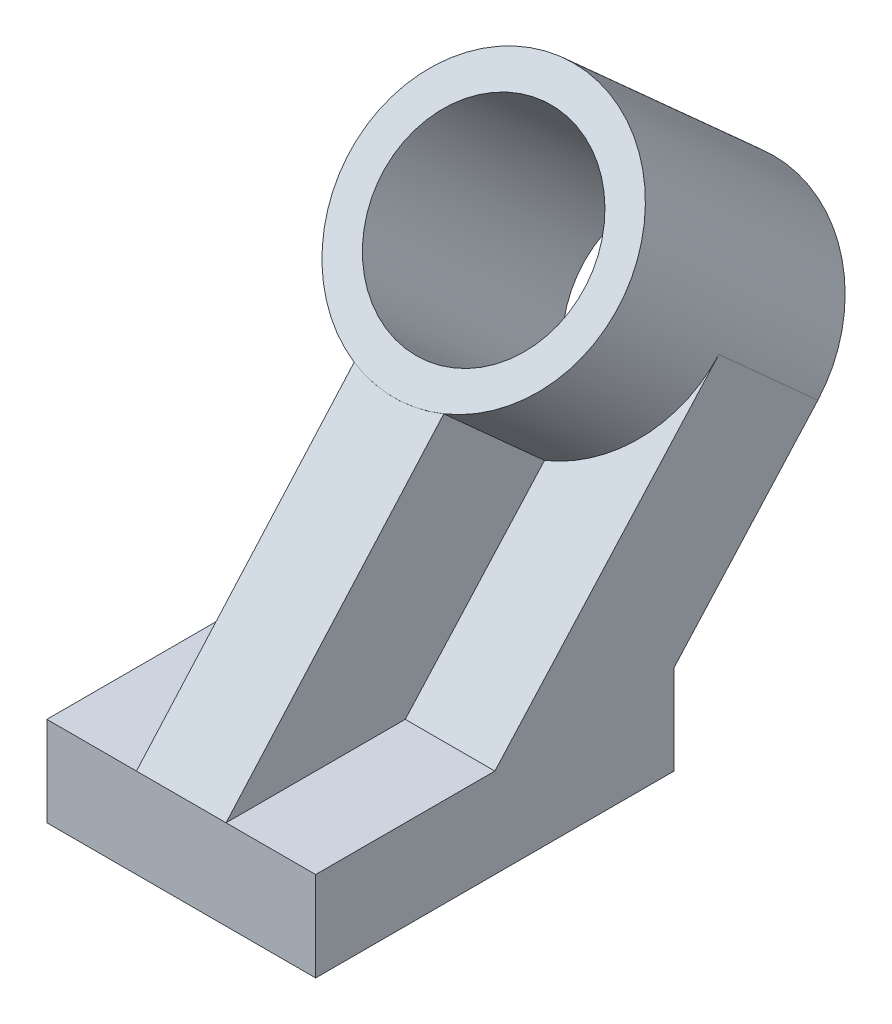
ISO-10303-21;
HEADER;
FILE_DESCRIPTION(('STEP AP214'),'2;1');
FILE_NAME('part.step','',(''),(''),'','','');
FILE_SCHEMA(('AUTOMOTIVE_DESIGN { 1 0 10303 214 1 1 1 1 }'));
ENDSEC;
DATA;
#1=APPLICATION_CONTEXT('core data for automotive mechanical design processes');
#2=APPLICATION_PROTOCOL_DEFINITION('international standard','automotive_design',2000,#1);
#3=PRODUCT_CONTEXT('',#1,'mechanical');
#4=PRODUCT('Part','Part','',(#3));
#5=PRODUCT_RELATED_PRODUCT_CATEGORY('part','',(#4));
#6=PRODUCT_DEFINITION_FORMATION('','',#4);
#7=PRODUCT_DEFINITION_CONTEXT('part definition',#1,'design');
#8=PRODUCT_DEFINITION('design','',#6,#7);
#9=PRODUCT_DEFINITION_SHAPE('','',#8);
#10=(LENGTH_UNIT() NAMED_UNIT(*) SI_UNIT(.MILLI.,.METRE.));
#11=(NAMED_UNIT(*) PLANE_ANGLE_UNIT() SI_UNIT($,.RADIAN.));
#12=(NAMED_UNIT(*) SI_UNIT($,.STERADIAN.) SOLID_ANGLE_UNIT());
#13=UNCERTAINTY_MEASURE_WITH_UNIT(LENGTH_MEASURE(1.E-05),#10,'distance_accuracy_value','');
#14=(GEOMETRIC_REPRESENTATION_CONTEXT(3) GLOBAL_UNCERTAINTY_ASSIGNED_CONTEXT((#13)) GLOBAL_UNIT_ASSIGNED_CONTEXT((#10,
#11,#12)) REPRESENTATION_CONTEXT('',''));
#15=CARTESIAN_POINT('',(0.,0.,0.));
#16=DIRECTION('',(0.,0.,1.));
#17=DIRECTION('',(1.,0.,0.));
#18=AXIS2_PLACEMENT_3D('',#15,#16,#17);
#19=CARTESIAN_POINT('',(38.1,25.4,-50.8));
#20=DIRECTION('',(0.,-0.669130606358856,-0.743144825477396));
#21=DIRECTION('',(0.,0.743144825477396,-0.669130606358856));
#22=AXIS2_PLACEMENT_3D('',#19,#20,#21);
#23=PLANE('',#22);
#24=DIRECTION('',(0.,0.743144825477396,-0.669130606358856));
#25=VECTOR('',#24,1.);
#26=CARTESIAN_POINT('',(12.7,25.4,-50.8));
#27=LINE('',#26,#25);
#28=CARTESIAN_POINT('',(12.7,25.4,-50.8));
#29=VERTEX_POINT('',#28);
#30=CARTESIAN_POINT('',(12.7,69.2293712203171,-90.2641431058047));
#31=VERTEX_POINT('',#30);
#32=EDGE_CURVE('E48',#29,#31,#27,.T.);
#33=ORIENTED_EDGE('',*,*,#32,.F.);
#34=DIRECTION('',(-1.,0.,0.));
#35=VECTOR('',#34,1.);
#36=CARTESIAN_POINT('',(38.1,25.4,-50.8));
#37=LINE('',#36,#35);
#38=CARTESIAN_POINT('',(38.1,25.4,-50.8));
#39=VERTEX_POINT('',#38);
#40=EDGE_CURVE('E117',#39,#29,#37,.T.);
#41=ORIENTED_EDGE('',*,*,#40,.F.);
#42=DIRECTION('',(0.,-0.743144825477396,0.669130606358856));
#43=VECTOR('',#42,1.);
#44=CARTESIAN_POINT('',(38.1,25.4,-50.8));
#45=LINE('',#44,#43);
#46=CARTESIAN_POINT('',(38.1,95.9238946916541,-114.3));
#47=VERTEX_POINT('',#46);
#48=EDGE_CURVE('E103',#47,#39,#45,.T.);
#49=ORIENTED_EDGE('',*,*,#48,.F.);
#50=CARTESIAN_POINT('',(0.,95.9238946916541,-114.3));
#51=DIRECTION('',(0.,-0.669130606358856,-0.743144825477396));
#52=DIRECTION('',(0.,0.743144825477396,-0.669130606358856));
#53=AXIS2_PLACEMENT_3D('',#50,#51,#52);
#54=CIRCLE('',#53,38.1);
#55=EDGE_CURVE('E133',#47,#31,#54,.T.);
#56=ORIENTED_EDGE('',*,*,#55,.T.);
#57=EDGE_LOOP('',(#33,#41,#49,#56));
#58=FACE_BOUND('',#57,.T.);
#59=ADVANCED_FACE('F33',(#58),#23,.F.);
#60=CARTESIAN_POINT('',(38.1,25.4,0.));
#61=DIRECTION('',(0.,-1.,0.));
#62=DIRECTION('',(0.,0.,-1.));
#63=AXIS2_PLACEMENT_3D('',#60,#61,#62);
#64=PLANE('',#63);
#65=DIRECTION('',(0.,0.,-1.));
#66=VECTOR('',#65,1.);
#67=CARTESIAN_POINT('',(12.7,25.4,0.));
#68=LINE('',#67,#66);
#69=CARTESIAN_POINT('',(12.7,25.4,0.));
#70=VERTEX_POINT('',#69);
#71=EDGE_CURVE('E379',#70,#29,#68,.T.);
#72=ORIENTED_EDGE('',*,*,#71,.F.);
#73=DIRECTION('',(-1.,0.,0.));
#74=VECTOR('',#73,1.);
#75=CARTESIAN_POINT('',(38.1,25.4,0.));
#76=LINE('',#75,#74);
#77=CARTESIAN_POINT('',(38.1,25.4,0.));
#78=VERTEX_POINT('',#77);
#79=EDGE_CURVE('E125',#78,#70,#76,.T.);
#80=ORIENTED_EDGE('',*,*,#79,.F.);
#81=DIRECTION('',(0.,0.,1.));
#82=VECTOR('',#81,1.);
#83=CARTESIAN_POINT('',(38.1,25.4,0.));
#84=LINE('',#83,#82);
#85=EDGE_CURVE('E107',#39,#78,#84,.T.);
#86=ORIENTED_EDGE('',*,*,#85,.F.);
#87=ORIENTED_EDGE('',*,*,#40,.T.);
#88=EDGE_LOOP('',(#72,#80,#86,#87));
#89=FACE_BOUND('',#88,.T.);
#90=ADVANCED_FACE('F123',(#89),#64,.F.);
#91=CARTESIAN_POINT('',(38.1,0.,-101.6));
#92=DIRECTION('',(0.,1.,0.));
#93=DIRECTION('',(0.,0.,1.));
#94=AXIS2_PLACEMENT_3D('',#91,#92,#93);
#95=PLANE('',#94);
#96=DIRECTION('',(0.,0.,-1.));
#97=VECTOR('',#96,1.);
#98=CARTESIAN_POINT('',(-38.1,0.,-101.6));
#99=LINE('',#98,#97);
#100=CARTESIAN_POINT('',(-38.1,0.,0.));
#101=VERTEX_POINT('',#100);
#102=CARTESIAN_POINT('',(-38.1,0.,-101.6));
#103=VERTEX_POINT('',#102);
#104=EDGE_CURVE('E130',#101,#103,#99,.T.);
#105=ORIENTED_EDGE('',*,*,#104,.T.);
#106=DIRECTION('',(-1.,0.,0.));
#107=VECTOR('',#106,1.);
#108=CARTESIAN_POINT('',(38.1,0.,-101.6));
#109=LINE('',#108,#107);
#110=CARTESIAN_POINT('',(38.1,0.,-101.6));
#111=VERTEX_POINT('',#110);
#112=EDGE_CURVE('E11',#111,#103,#109,.T.);
#113=ORIENTED_EDGE('',*,*,#112,.F.);
#114=DIRECTION('',(0.,0.,-1.));
#115=VECTOR('',#114,1.);
#116=CARTESIAN_POINT('',(38.1,0.,-101.6));
#117=LINE('',#116,#115);
#118=CARTESIAN_POINT('',(38.1,0.,0.));
#119=VERTEX_POINT('',#118);
#120=EDGE_CURVE('E149',#119,#111,#117,.T.);
#121=ORIENTED_EDGE('',*,*,#120,.F.);
#122=DIRECTION('',(-1.,0.,0.));
#123=VECTOR('',#122,1.);
#124=CARTESIAN_POINT('',(38.1,0.,0.));
#125=LINE('',#124,#123);
#126=EDGE_CURVE('E83',#119,#101,#125,.T.);
#127=ORIENTED_EDGE('',*,*,#126,.T.);
#128=EDGE_LOOP('',(#105,#113,#121,#127));
#129=FACE_BOUND('',#128,.T.);
#130=ADVANCED_FACE('F35',(#129),#95,.F.);
#131=CARTESIAN_POINT('',(38.1,25.4,-101.6));
#132=DIRECTION('',(0.,0.,1.));
#133=DIRECTION('',(1.,0.,0.));
#134=AXIS2_PLACEMENT_3D('',#131,#132,#133);
#135=PLANE('',#134);
#136=DIRECTION('',(0.,1.,0.));
#137=VECTOR('',#136,1.);
#138=CARTESIAN_POINT('',(-38.1,25.4,-101.6));
#139=LINE('',#138,#137);
#140=CARTESIAN_POINT('',(-38.1,25.4,-101.6));
#141=VERTEX_POINT('',#140);
#142=EDGE_CURVE('E132',#103,#141,#139,.T.);
#143=ORIENTED_EDGE('',*,*,#142,.T.);
#144=DIRECTION('',(-1.,0.,0.));
#145=VECTOR('',#144,1.);
#146=CARTESIAN_POINT('',(38.1,25.4,-101.6));
#147=LINE('',#146,#145);
#148=CARTESIAN_POINT('',(38.1,25.4,-101.6));
#149=VERTEX_POINT('',#148);
#150=EDGE_CURVE('E41',#149,#141,#147,.T.);
#151=ORIENTED_EDGE('',*,*,#150,.F.);
#152=DIRECTION('',(0.,1.,0.));
#153=VECTOR('',#152,1.);
#154=CARTESIAN_POINT('',(38.1,25.4,-101.6));
#155=LINE('',#154,#153);
#156=EDGE_CURVE('E91',#111,#149,#155,.T.);
#157=ORIENTED_EDGE('',*,*,#156,.F.);
#158=ORIENTED_EDGE('',*,*,#112,.T.);
#159=EDGE_LOOP('',(#143,#151,#157,#158));
#160=FACE_BOUND('',#159,.T.);
#161=ADVANCED_FACE('F159',(#160),#135,.F.);
#162=CARTESIAN_POINT('',(38.1,70.6630385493,-142.355022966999));
#163=DIRECTION('',(0.,0.669130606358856,0.743144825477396));
#164=DIRECTION('',(0.,-0.743144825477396,0.669130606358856));
#165=AXIS2_PLACEMENT_3D('',#162,#163,#164);
#166=PLANE('',#165);
#167=CARTESIAN_POINT('',(0.,70.6630385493,-142.355022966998));
#168=DIRECTION('',(0.,0.669130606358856,0.743144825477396));
#169=DIRECTION('',(0.,-0.743144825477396,0.669130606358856));
#170=AXIS2_PLACEMENT_3D('',#167,#168,#169);
#171=CIRCLE('',#170,28.575);
#172=CARTESIAN_POINT('',(0.,49.4276751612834,-123.234615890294));
#173=VERTEX_POINT('',#172);
#174=EDGE_CURVE('E172',#173,#173,#171,.T.);
#175=ORIENTED_EDGE('',*,*,#174,.T.);
#176=EDGE_LOOP('',(#175));
#177=FACE_BOUND('',#176,.T.);
#178=CARTESIAN_POINT('',(0.,70.6630385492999,-142.355022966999));
#179=DIRECTION('',(0.,-0.669130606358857,-0.743144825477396));
#180=DIRECTION('',(0.,0.743144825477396,-0.669130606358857));
#181=AXIS2_PLACEMENT_3D('',#178,#179,#180);
#182=CIRCLE('',#181,38.1);
#183=CARTESIAN_POINT('',(-38.1,70.6630385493,-142.355022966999));
#184=VERTEX_POINT('',#183);
#185=CARTESIAN_POINT('',(38.1,70.6630385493,-142.355022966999));
#186=VERTEX_POINT('',#185);
#187=EDGE_CURVE('E169',#184,#186,#182,.T.);
#188=ORIENTED_EDGE('',*,*,#187,.T.);
#189=DIRECTION('',(0.,0.743144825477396,-0.669130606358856));
#190=VECTOR('',#189,1.);
#191=CARTESIAN_POINT('',(38.1,70.6630385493,-142.355022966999));
#192=LINE('',#191,#190);
#193=EDGE_CURVE('E157',#149,#186,#192,.T.);
#194=ORIENTED_EDGE('',*,*,#193,.F.);
#195=ORIENTED_EDGE('',*,*,#150,.T.);
#196=DIRECTION('',(0.,0.743144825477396,-0.669130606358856));
#197=VECTOR('',#196,1.);
#198=CARTESIAN_POINT('',(-38.1,70.6630385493,-142.355022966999));
#199=LINE('',#198,#197);
#200=EDGE_CURVE('E136',#141,#184,#199,.T.);
#201=ORIENTED_EDGE('',*,*,#200,.T.);
#202=EDGE_LOOP('',(#188,#194,#195,#201));
#203=FACE_BOUND('',#202,.T.);
#204=ADVANCED_FACE('F154',(#177,#203),#166,.F.);
#205=CARTESIAN_POINT('',(-12.7,25.4,-50.8));
#206=VERTEX_POINT('',#205);
#207=CARTESIAN_POINT('',(-38.1,25.4,-50.8));
#208=VERTEX_POINT('',#207);
#209=EDGE_CURVE('E121',#206,#208,#37,.T.);
#210=ORIENTED_EDGE('',*,*,#209,.F.);
#211=DIRECTION('',(0.,0.743144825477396,-0.669130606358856));
#212=VECTOR('',#211,1.);
#213=CARTESIAN_POINT('',(-12.7,25.4,-50.8));
#214=LINE('',#213,#212);
#215=CARTESIAN_POINT('',(-12.7,69.2293712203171,-90.2641431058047));
#216=VERTEX_POINT('',#215);
#217=EDGE_CURVE('E205',#206,#216,#214,.T.);
#218=ORIENTED_EDGE('',*,*,#217,.T.);
#219=CARTESIAN_POINT('',(-38.1,95.9238946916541,-114.3));
#220=VERTEX_POINT('',#219);
#221=EDGE_CURVE('E175',#216,#220,#54,.T.);
#222=ORIENTED_EDGE('',*,*,#221,.T.);
#223=DIRECTION('',(0.,-0.743144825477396,0.669130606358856));
#224=VECTOR('',#223,1.);
#225=CARTESIAN_POINT('',(-38.1,25.4,-50.8));
#226=LINE('',#225,#224);
#227=EDGE_CURVE('E141',#220,#208,#226,.T.);
#228=ORIENTED_EDGE('',*,*,#227,.T.);
#229=EDGE_LOOP('',(#210,#218,#222,#228));
#230=FACE_BOUND('',#229,.T.);
#231=ADVANCED_FACE('F202',(#230),#23,.F.);
#232=CARTESIAN_POINT('',(-12.7,25.4,0.));
#233=VERTEX_POINT('',#232);
#234=CARTESIAN_POINT('',(-38.1,25.4,0.));
#235=VERTEX_POINT('',#234);
#236=EDGE_CURVE('E151',#233,#235,#76,.T.);
#237=ORIENTED_EDGE('',*,*,#236,.F.);
#238=DIRECTION('',(0.,0.,-1.));
#239=VECTOR('',#238,1.);
#240=CARTESIAN_POINT('',(-12.7,25.4,0.));
#241=LINE('',#240,#239);
#242=EDGE_CURVE('E198',#233,#206,#241,.T.);
#243=ORIENTED_EDGE('',*,*,#242,.T.);
#244=ORIENTED_EDGE('',*,*,#209,.T.);
#245=DIRECTION('',(0.,0.,1.));
#246=VECTOR('',#245,1.);
#247=CARTESIAN_POINT('',(-38.1,25.4,0.));
#248=LINE('',#247,#246);
#249=EDGE_CURVE('E144',#208,#235,#248,.T.);
#250=ORIENTED_EDGE('',*,*,#249,.T.);
#251=EDGE_LOOP('',(#237,#243,#244,#250));
#252=FACE_BOUND('',#251,.T.);
#253=ADVANCED_FACE('F194',(#252),#64,.F.);
#254=CARTESIAN_POINT('',(38.1,0.,0.));
#255=DIRECTION('',(0.,0.,-1.));
#256=DIRECTION('',(-1.,0.,0.));
#257=AXIS2_PLACEMENT_3D('',#254,#255,#256);
#258=PLANE('',#257);
#259=DIRECTION('',(0.,-1.,0.));
#260=VECTOR('',#259,1.);
#261=CARTESIAN_POINT('',(-38.1,0.,0.));
#262=LINE('',#261,#260);
#263=EDGE_CURVE('E147',#235,#101,#262,.T.);
#264=ORIENTED_EDGE('',*,*,#263,.T.);
#265=ORIENTED_EDGE('',*,*,#126,.F.);
#266=DIRECTION('',(0.,-1.,0.));
#267=VECTOR('',#266,1.);
#268=CARTESIAN_POINT('',(38.1,0.,0.));
#269=LINE('',#268,#267);
#270=EDGE_CURVE('E57',#78,#119,#269,.T.);
#271=ORIENTED_EDGE('',*,*,#270,.F.);
#272=ORIENTED_EDGE('',*,*,#79,.T.);
#273=DIRECTION('',(-1.,0.,0.));
#274=VECTOR('',#273,1.);
#275=CARTESIAN_POINT('',(38.1,25.4,0.));
#276=LINE('',#275,#274);
#277=EDGE_CURVE('E191',#233,#70,#276,.F.);
#278=ORIENTED_EDGE('',*,*,#277,.F.);
#279=ORIENTED_EDGE('',*,*,#236,.T.);
#280=EDGE_LOOP('',(#264,#265,#271,#272,#278,#279));
#281=FACE_BOUND('',#280,.T.);
#282=ADVANCED_FACE('F186',(#281),#258,.F.);
#283=CARTESIAN_POINT('',(38.1,0.,0.));
#284=DIRECTION('',(-1.,0.,0.));
#285=DIRECTION('',(0.,0.,1.));
#286=AXIS2_PLACEMENT_3D('',#283,#284,#285);
#287=PLANE('',#286);
#288=ORIENTED_EDGE('',*,*,#120,.T.);
#289=ORIENTED_EDGE('',*,*,#156,.T.);
#290=ORIENTED_EDGE('',*,*,#193,.T.);
#291=DIRECTION('',(0.,0.669130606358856,0.743144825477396));
#292=VECTOR('',#291,1.);
#293=CARTESIAN_POINT('',(38.1,95.9238946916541,-114.3));
#294=LINE('',#293,#292);
#295=EDGE_CURVE('E111',#186,#47,#294,.T.);
#296=ORIENTED_EDGE('',*,*,#295,.T.);
#297=ORIENTED_EDGE('',*,*,#48,.T.);
#298=ORIENTED_EDGE('',*,*,#85,.T.);
#299=ORIENTED_EDGE('',*,*,#270,.T.);
#300=EDGE_LOOP('',(#288,#289,#290,#296,#297,#298,#299));
#301=FACE_BOUND('',#300,.T.);
#302=ADVANCED_FACE('F105',(#301),#287,.F.);
#303=CARTESIAN_POINT('',(-38.1,0.,0.));
#304=DIRECTION('',(-1.,0.,0.));
#305=DIRECTION('',(0.,0.,1.));
#306=AXIS2_PLACEMENT_3D('',#303,#304,#305);
#307=PLANE('',#306);
#308=ORIENTED_EDGE('',*,*,#104,.F.);
#309=ORIENTED_EDGE('',*,*,#263,.F.);
#310=ORIENTED_EDGE('',*,*,#249,.F.);
#311=ORIENTED_EDGE('',*,*,#227,.F.);
#312=DIRECTION('',(0.,0.669130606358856,0.743144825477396));
#313=VECTOR('',#312,1.);
#314=CARTESIAN_POINT('',(-38.1,95.9238946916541,-114.3));
#315=LINE('',#314,#313);
#316=EDGE_CURVE('E138',#184,#220,#315,.T.);
#317=ORIENTED_EDGE('',*,*,#316,.F.);
#318=ORIENTED_EDGE('',*,*,#200,.F.);
#319=ORIENTED_EDGE('',*,*,#142,.F.);
#320=EDGE_LOOP('',(#308,#309,#310,#311,#317,#318,#319));
#321=FACE_BOUND('',#320,.T.);
#322=ADVANCED_FACE('F163',(#321),#307,.T.);
#323=CARTESIAN_POINT('',(0.,121.650790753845,-85.727387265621));
#324=DIRECTION('',(0.,-0.669130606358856,-0.743144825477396));
#325=DIRECTION('',(0.,0.743144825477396,-0.669130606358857));
#326=AXIS2_PLACEMENT_3D('',#323,#324,#325);
#327=CYLINDRICAL_SURFACE('',#326,38.1);
#328=CARTESIAN_POINT('',(0.,121.650790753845,-85.727387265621));
#329=DIRECTION('',(0.,-0.669130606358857,-0.743144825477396));
#330=DIRECTION('',(0.,0.743144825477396,-0.669130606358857));
#331=AXIS2_PLACEMENT_3D('',#328,#329,#330);
#332=CIRCLE('',#331,38.1);
#333=CARTESIAN_POINT('',(0.,149.964608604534,-111.221263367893));
#334=VERTEX_POINT('',#333);
#335=EDGE_CURVE('E171',#334,#334,#332,.T.);
#336=ORIENTED_EDGE('',*,*,#335,.T.);
#337=EDGE_LOOP('',(#336));
#338=FACE_BOUND('',#337,.T.);
#339=ORIENTED_EDGE('',*,*,#295,.F.);
#340=ORIENTED_EDGE('',*,*,#187,.F.);
#341=ORIENTED_EDGE('',*,*,#316,.T.);
#342=ORIENTED_EDGE('',*,*,#221,.F.);
#343=DIRECTION('',(0.,-0.669130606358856,-0.743144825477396));
#344=VECTOR('',#343,1.);
#345=CARTESIAN_POINT('',(-12.7,94.9562672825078,-61.6915303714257));
#346=LINE('',#345,#344);
#347=CARTESIAN_POINT('',(-12.7,94.9221397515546,-61.7294328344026));
#348=VERTEX_POINT('',#347);
#349=EDGE_CURVE('E210',#348,#216,#346,.T.);
#350=ORIENTED_EDGE('',*,*,#349,.F.);
#351=CARTESIAN_POINT('',(0.,121.783542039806,-85.5799520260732));
#352=DIRECTION('',(0.,-0.663955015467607,-0.747772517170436));
#353=DIRECTION('',(0.,-0.747772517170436,0.663955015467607));
#354=AXIS2_PLACEMENT_3D('',#351,#352,#353);
#355=ELLIPSE('',#354,38.1009182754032,38.1);
#356=CARTESIAN_POINT('',(12.7,94.9221397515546,-61.7294328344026));
#357=VERTEX_POINT('',#356);
#358=EDGE_CURVE('E231',#357,#348,#355,.T.);
#359=ORIENTED_EDGE('',*,*,#358,.F.);
#360=DIRECTION('',(0.,-0.669130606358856,-0.743144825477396));
#361=VECTOR('',#360,1.);
#362=CARTESIAN_POINT('',(12.7,94.9562672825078,-61.6915303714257));
#363=LINE('',#362,#361);
#364=EDGE_CURVE('E223',#357,#31,#363,.T.);
#365=ORIENTED_EDGE('',*,*,#364,.T.);
#366=ORIENTED_EDGE('',*,*,#55,.F.);
#367=EDGE_LOOP('',(#339,#340,#341,#342,#350,#359,#365,#366));
#368=FACE_BOUND('',#367,.T.);
#369=ADVANCED_FACE('F170',(#338,#368),#327,.T.);
#370=CARTESIAN_POINT('',(0.,121.650790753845,-85.727387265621));
#371=DIRECTION('',(0.,-0.669130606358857,-0.743144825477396));
#372=DIRECTION('',(0.,0.743144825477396,-0.669130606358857));
#373=AXIS2_PLACEMENT_3D('',#370,#371,#372);
#374=PLANE('',#373);
#375=CARTESIAN_POINT('',(0.,121.650790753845,-85.727387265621));
#376=DIRECTION('',(0.,0.669130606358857,0.743144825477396));
#377=DIRECTION('',(0.,-0.743144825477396,0.669130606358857));
#378=AXIS2_PLACEMENT_3D('',#375,#376,#377);
#379=CIRCLE('',#378,28.575);
#380=CARTESIAN_POINT('',(0.,100.415427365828,-66.6069801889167));
#381=VERTEX_POINT('',#380);
#382=EDGE_CURVE('E178',#381,#381,#379,.T.);
#383=ORIENTED_EDGE('',*,*,#382,.F.);
#384=EDGE_LOOP('',(#383));
#385=FACE_BOUND('',#384,.T.);
#386=ORIENTED_EDGE('',*,*,#335,.F.);
#387=EDGE_LOOP('',(#386));
#388=FACE_BOUND('',#387,.T.);
#389=ADVANCED_FACE('F244',(#385,#388),#374,.F.);
#390=CARTESIAN_POINT('',(0.,26.3475596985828,-191.572348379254));
#391=DIRECTION('',(0.,0.669130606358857,0.743144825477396));
#392=DIRECTION('',(0.,-0.743144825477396,0.669130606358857));
#393=AXIS2_PLACEMENT_3D('',#390,#391,#392);
#394=CYLINDRICAL_SURFACE('',#393,28.575);
#395=ORIENTED_EDGE('',*,*,#174,.F.);
#396=EDGE_LOOP('',(#395));
#397=FACE_BOUND('',#396,.T.);
#398=ORIENTED_EDGE('',*,*,#382,.T.);
#399=EDGE_LOOP('',(#398));
#400=FACE_BOUND('',#399,.T.);
#401=ADVANCED_FACE('F242',(#397,#400),#394,.F.);
#402=CARTESIAN_POINT('',(-12.7,74.9823043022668,-83.9244495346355));
#403=DIRECTION('',(-1.,0.,0.));
#404=DIRECTION('',(0.,0.,1.));
#405=AXIS2_PLACEMENT_3D('',#402,#403,#404);
#406=PLANE('',#405);
#407=DIRECTION('',(0.,-0.747772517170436,0.663955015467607));
#408=VECTOR('',#407,1.);
#409=CARTESIAN_POINT('',(-12.7,100.415427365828,-66.6069801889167));
#410=LINE('',#409,#408);
#411=EDGE_CURVE('E232',#348,#233,#410,.T.);
#412=ORIENTED_EDGE('',*,*,#411,.F.);
#413=ORIENTED_EDGE('',*,*,#349,.T.);
#414=ORIENTED_EDGE('',*,*,#217,.F.);
#415=ORIENTED_EDGE('',*,*,#242,.F.);
#416=EDGE_LOOP('',(#412,#413,#414,#415));
#417=FACE_BOUND('',#416,.T.);
#418=ADVANCED_FACE('F276',(#417),#406,.T.);
#419=CARTESIAN_POINT('',(12.7,74.9823043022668,-83.9244495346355));
#420=DIRECTION('',(-1.,0.,0.));
#421=DIRECTION('',(0.,0.,1.));
#422=AXIS2_PLACEMENT_3D('',#419,#420,#421);
#423=PLANE('',#422);
#424=ORIENTED_EDGE('',*,*,#364,.F.);
#425=DIRECTION('',(0.,-0.747772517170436,0.663955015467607));
#426=VECTOR('',#425,1.);
#427=CARTESIAN_POINT('',(12.7,100.415427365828,-66.6069801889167));
#428=LINE('',#427,#426);
#429=EDGE_CURVE('E226',#357,#70,#428,.T.);
#430=ORIENTED_EDGE('',*,*,#429,.T.);
#431=ORIENTED_EDGE('',*,*,#71,.T.);
#432=ORIENTED_EDGE('',*,*,#32,.T.);
#433=EDGE_LOOP('',(#424,#430,#431,#432));
#434=FACE_BOUND('',#433,.T.);
#435=ADVANCED_FACE('F225',(#434),#423,.F.);
#436=CARTESIAN_POINT('',(0.,100.415427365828,-66.6069801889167));
#437=DIRECTION('',(0.,-0.663955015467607,-0.747772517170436));
#438=DIRECTION('',(0.,-0.747772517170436,0.663955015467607));
#439=AXIS2_PLACEMENT_3D('',#436,#437,#438);
#440=PLANE('',#439);
#441=ORIENTED_EDGE('',*,*,#411,.T.);
#442=ORIENTED_EDGE('',*,*,#277,.T.);
#443=ORIENTED_EDGE('',*,*,#429,.F.);
#444=ORIENTED_EDGE('',*,*,#358,.T.);
#445=EDGE_LOOP('',(#441,#442,#443,#444));
#446=FACE_BOUND('',#445,.T.);
#447=ADVANCED_FACE('F230',(#446),#440,.F.);
#448=CLOSED_SHELL('',(#59,#90,#130,#161,#204,#231,#253,#282,#302,#322,#369,#389,#401,#418,#435,#447));
#449=MANIFOLD_SOLID_BREP('B2',#448);
#450=ADVANCED_BREP_SHAPE_REPRESENTATION('',(#18,#449),#14);
#451=SHAPE_DEFINITION_REPRESENTATION(#9,#450);
ENDSEC;
END-ISO-10303-21;
